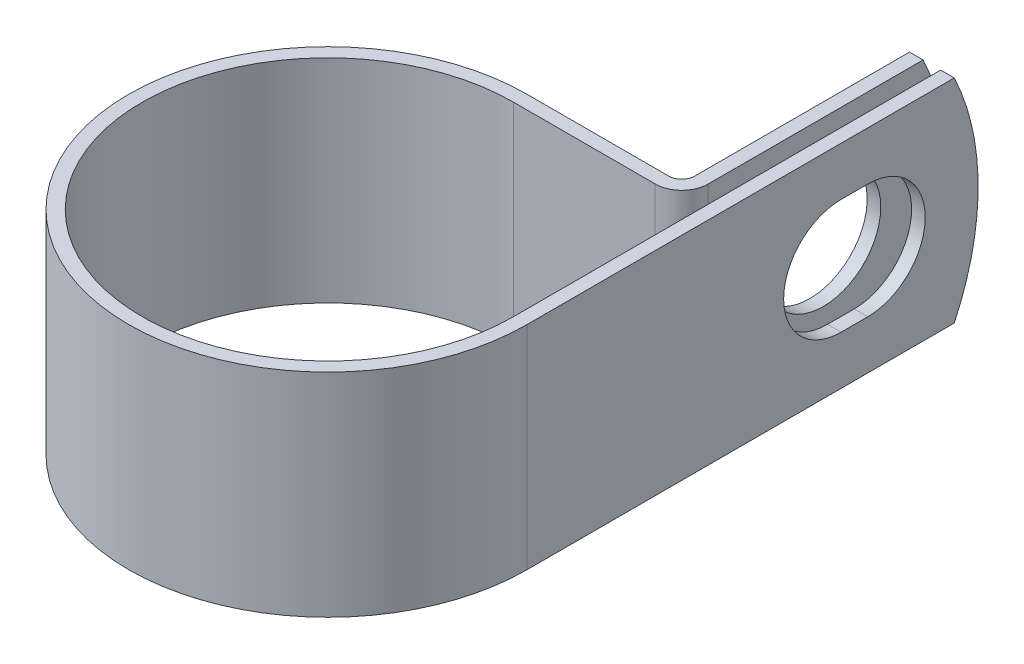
from build123d import *

# Parameters (mm, degrees)
EXTRUDE_THIN1_DEPTH = 9.525
SKETCH2_R           = 5.1562
CUT_EXTRUDE1_DEPTH  = 1.2192
CUT_EXTRUDE2_REACH  = 56.835
CUT_EXTRUDE3_DEPTH  = 53.306574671


with BuildPart() as part:
    # Sketch1 → Extrude-Thin1 (new, symmetric)
    with BuildSketch(Plane(origin=(0, 0, 0), x_dir=(1, 0, 0), z_dir=(0, 1, 0))):
        with BuildLine():
            Line((16.6624, 40.4622), (16.6624, 16.6624))
            Line((16.6624, 16.6624), (16.6624, 0))
            ThreePointArc((16.6624, 0), (-11.782096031, -11.782096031), (0, 16.6624))
            Line((0, 16.6624), (12.71016, 16.6624))
            ThreePointArc((12.71016, 16.6624), (14.391263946, 17.358736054), (15.0876, 19.03984))
            Line((15.0876, 19.03984), (15.0876, 40.4622))
            Line((15.0876, 40.4622), (13.8684, 40.4622))
            Line((13.8684, 40.4622), (13.8684, 19.03984))
            ThreePointArc((13.8684, 19.03984), (13.529159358, 18.220840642), (12.71016, 17.8816))
            Line((12.71016, 17.8816), (0, 17.8816))
            ThreePointArc((0, 17.8816), (-12.644200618, -12.644200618), (17.8816, 0))
            Line((17.8816, 0), (17.8816, 16.6624))
            Line((17.8816, 16.6624), (17.8816, 40.4622))
            Line((17.8816, 40.4622), (16.6624, 40.4622))
        make_face()
    extrude(amount=EXTRUDE_THIN1_DEPTH, both=True)

    # Sketch2 → Cut-Extrude1 (cut)
    with BuildSketch(Plane.ZY.offset(-13.8684)):
        with Locations((-29.3624, 0)):
            Circle(SKETCH2_R)
    extrude(amount=-CUT_EXTRUDE1_DEPTH, mode=Mode.SUBTRACT)

    # Sketch3 → Cut-Extrude2 (cut, up to next)
    with BuildSketch(Plane(origin=(17.8816, 0, 0), x_dir=(0, 0, -1), z_dir=(1, 0, 0)), mode=Mode.PRIVATE) as cut_extrude2_sk1:
        with BuildLine():
            Line((28.1686, 5.1562), (30.5562, 5.1562))
            ThreePointArc((30.5562, 5.1562), (35.7124, 0), (30.5562, -5.1562))
            Line((30.5562, -5.1562), (28.1686, -5.1562))
            ThreePointArc((28.1686, -5.1562), (23.0124, 0), (28.1686, 5.1562))
        make_face()
    cut_extrude2_tool1 = extrude(cut_extrude2_sk1.sketch, amount=-CUT_EXTRUDE2_REACH, mode=Mode.PRIVATE) & part.part
    add(cut_extrude2_tool1.solids().sort_by_distance((17.8816, 0, -29.3624))[0], mode=Mode.SUBTRACT)

    # Sketch4 → Cut-Extrude3 (cut, through all)
    with BuildSketch(Plane.ZY.offset(-13.8684)):
        with BuildLine():
            Line((-38.317663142, 9.525), (-40.4622, 9.525))
            Line((-40.4622, 9.525), (-40.4622, 0))
            ThreePointArc((-40.4622, 0), (-39.919438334, 4.881717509), (-38.317663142, 9.525))
        make_face()
        with BuildLine():
            ThreePointArc((-38.317663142, -9.525), (-39.919438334, -4.881717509), (-40.4622, 0))
            Line((-40.4622, 0), (-40.4622, -9.525))
            Line((-40.4622, -9.525), (-38.317663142, -9.525))
        make_face()
    extrude(amount=-CUT_EXTRUDE3_DEPTH, mode=Mode.SUBTRACT)


solid = part.part
